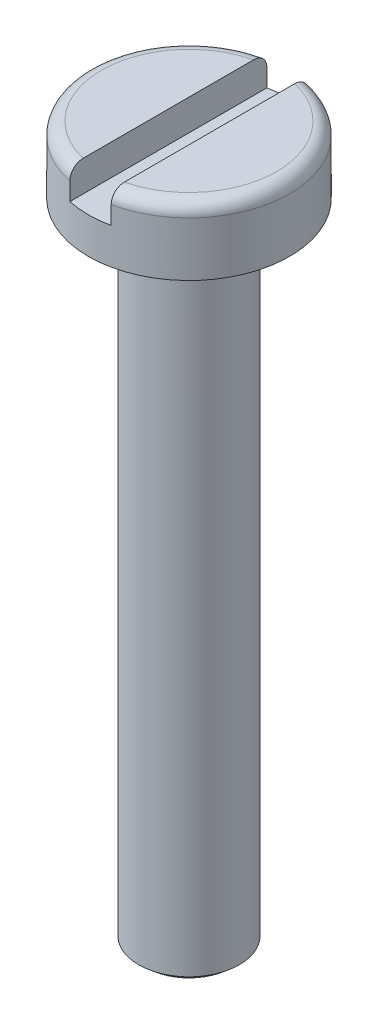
from build123d import *

# Parameters (mm, degrees)
ESQUISSE1_R             = 3.9
BOSS_EXTRU_1_DEPTH      = 2.6
ESQUISSE2_W             = 1.6
ESQUISSE2_H             = 1.2
ENL_V_MAT_EXTRU_1_DEPTH = 7.5
CONG_1_R                = 0.5
ESQUISSE3_R             = 1.95
BOSS_EXTRU_2_DEPTH      = 25
CHANFREIN1_SIZE         = 0.25
CHANFREIN1_SIZE2        = 0.297938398


with BuildPart() as part:
    # Esquisse1 → Boss.-Extru.1 (new body)
    with BuildSketch(Plane(origin=(0, 0, 0), x_dir=(1, 0, 0), z_dir=(0, 1, 0))):
        with Locations(Location((0, 0, 0), (0, 0, 270))):
            Circle(ESQUISSE1_R)
    extrude(amount=BOSS_EXTRU_1_DEPTH)

    # Esquisse2 → Enl_v. mat.-Extru.1 (cut, symmetric)
    with BuildSketch(Plane.XY):
        with Locations((0, 2)):
            Rectangle(ESQUISSE2_W, ESQUISSE2_H)
    extrude(amount=ENL_V_MAT_EXTRU_1_DEPTH, both=True, mode=Mode.SUBTRACT)

    # Cong_1
    cong_1_edges = [part.edges().sort_by_distance(p)[0] for p in [
        (3.9, 2.6, 0),
        (-3.9, 2.6, 0),
    ]]
    fillet(cong_1_edges, radius=CONG_1_R)

    # Esquisse3 → Boss.-Extru.2 (add)
    with BuildSketch(Plane.XZ):
        with Locations(Location((0, 0, 0), (0, 0, 90))):
            Circle(ESQUISSE3_R)
    extrude(amount=BOSS_EXTRU_2_DEPTH)

    # Chanfrein1
    chanfrein1_edges = [part.edges().sort_by_distance(p)[0] for p in [
        (0, -25, -1.95),
    ]]
    chanfrein1_side = [part.faces().sort_by_distance(p)[0] for p in [
        (0, -12.5, -1.95),
    ]]
    chamfer(chanfrein1_edges, length=CHANFREIN1_SIZE, length2=CHANFREIN1_SIZE2, reference=chanfrein1_side[0])


solid = part.part
